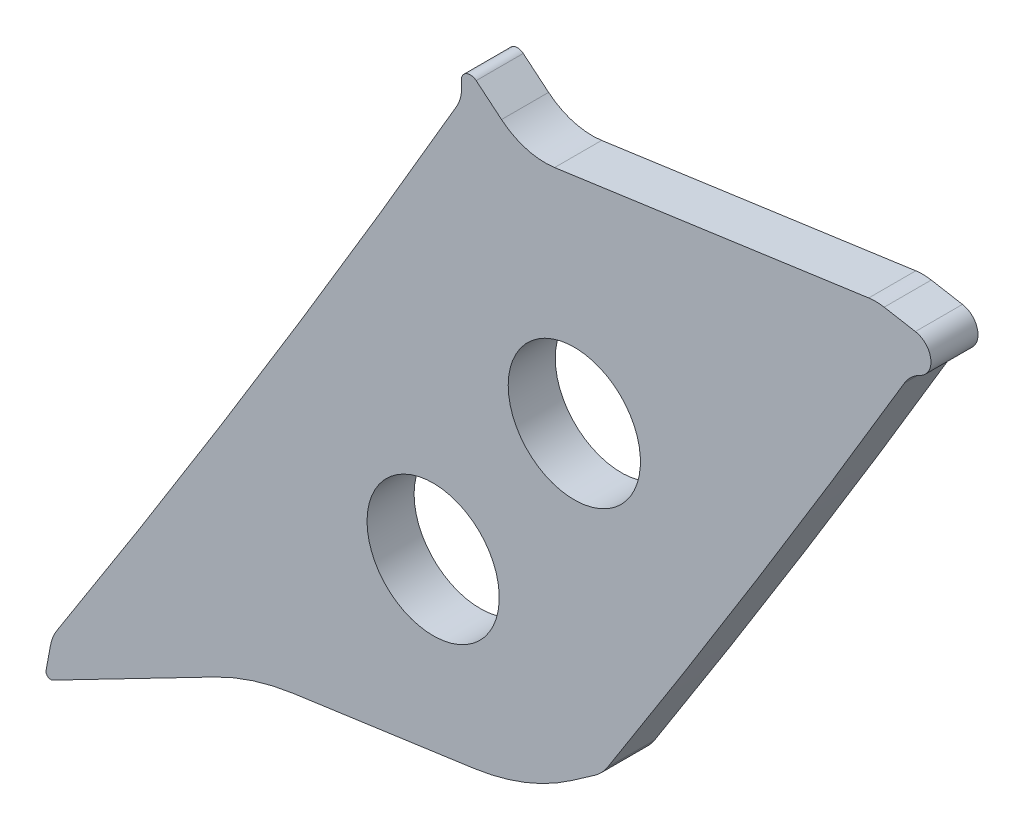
from build123d import *

# Parameters (mm, degrees)
BOSS_EXTRUDE1_DEPTH = 2.54
HOLE1_D             = 7.1374


with BuildPart() as part:
    # Sketch1 → Boss-Extrude1 (new body)
    with BuildSketch(Plane.XY):
        with BuildLine():
            Line((-932.521499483, 21.181671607), (-932.753780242, 19.923399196))
            ThreePointArc((-932.753780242, 19.923399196), (-932.655321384, 19.673284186), (-932.387397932, 19.651634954))
            Line((-932.387397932, 19.651634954), (-923.637335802, 24.173069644))
            ThreePointArc((-923.637335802, 24.173069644), (-921.581630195, 25.024365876), (-919.412194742, 25.518512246))
            Line((-919.412194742, 25.518512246), (-909.658835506, 26.889257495))
            ThreePointArc((-909.658835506, 26.889257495), (-906.902123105, 27.613107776), (-904.388794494, 28.957206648))
            Line((-904.388794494, 28.957206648), (-903.138119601, 29.828061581))
            ThreePointArc((-903.138119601, 29.828061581), (-902.760242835, 30.15034623), (-902.452304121, 30.54000248))
            ThreePointArc((-902.452304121, 30.54000248), (-894.321080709, 43.456527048), (-886.424246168, 56.51766809))
            ThreePointArc((-886.424246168, 56.51766809), (-886.051606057, 56.977585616), (-885.562229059, 57.310594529))
            ThreePointArc((-885.562229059, 57.310594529), (-884.999083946, 58.365024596), (-885.828942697, 59.225425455))
            Line((-885.828942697, 59.225425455), (-887.513635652, 59.522482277))
            ThreePointArc((-887.513635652, 59.522482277), (-887.930209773, 59.562593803), (-888.347930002, 59.537044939))
            Line((-888.347930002, 59.537044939), (-905.304187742, 57.153998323))
            ThreePointArc((-905.304187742, 57.153998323), (-906.822124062, 57.258030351), (-908.16848255, 57.966741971))
            Line((-908.16848255, 57.966741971), (-909.536820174, 59.102055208))
            ThreePointArc((-909.536820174, 59.102055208), (-910.089435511, 59.153766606), (-910.338583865, 58.657799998))
            ThreePointArc((-910.338583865, 58.657799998), (-910.359123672, 57.992158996), (-910.593765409, 57.368906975))
            ThreePointArc((-910.593765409, 57.368906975), (-921.163753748, 39.60330992), (-932.158261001, 22.097256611))
            ThreePointArc((-932.158261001, 22.097256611), (-932.384688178, 21.657240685), (-932.521499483, 21.181671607))
        make_face()
    extrude(amount=-BOSS_EXTRUDE1_DEPTH)

    # Hole1 (through all)
    with Locations(Plane(origin=(-900.585739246, 56.321140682, -2.54), x_dir=(-1, 0, 0), z_dir=(0, 0, -1))):
        with Locations((3.654260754, -10.601140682), (11.274260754, -20.761140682)):
            Hole(HOLE1_D / 2)


solid = part.part
